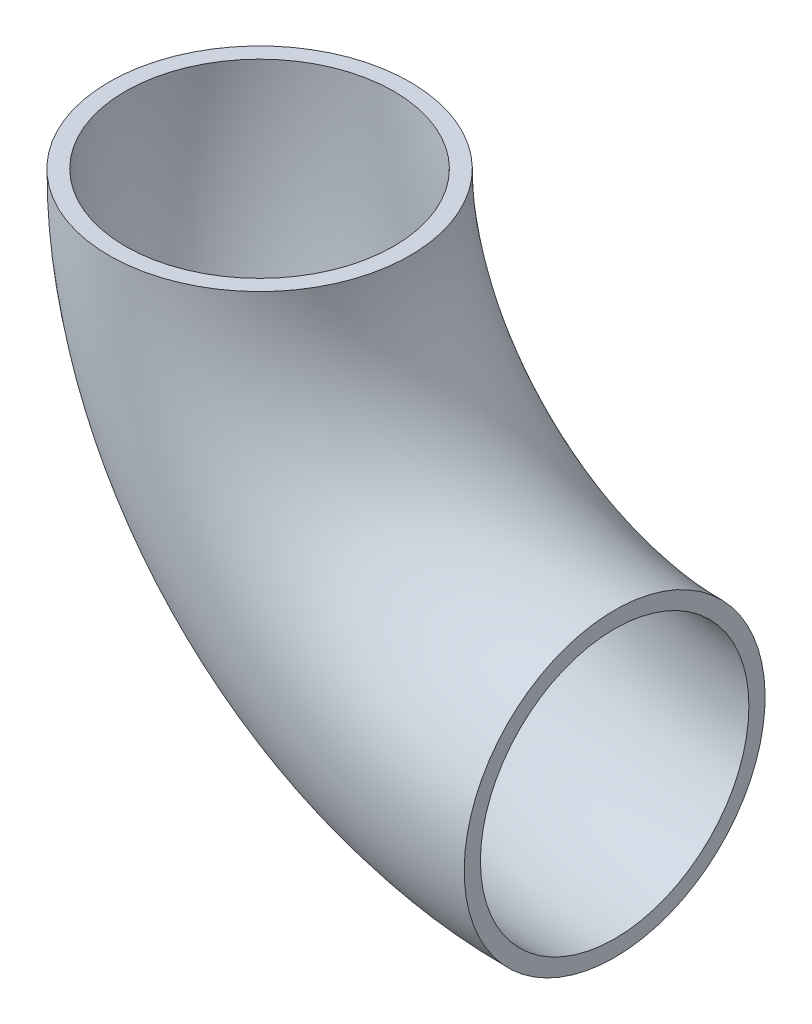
ISO-10303-21;
HEADER;
FILE_DESCRIPTION(('STEP AP214'),'2;1');
FILE_NAME('part.step','',(''),(''),'','','');
FILE_SCHEMA(('AUTOMOTIVE_DESIGN { 1 0 10303 214 1 1 1 1 }'));
ENDSEC;
DATA;
#1=APPLICATION_CONTEXT('core data for automotive mechanical design processes');
#2=APPLICATION_PROTOCOL_DEFINITION('international standard','automotive_design',2000,#1);
#3=PRODUCT_CONTEXT('',#1,'mechanical');
#4=PRODUCT('Part','Part','',(#3));
#5=PRODUCT_RELATED_PRODUCT_CATEGORY('part','',(#4));
#6=PRODUCT_DEFINITION_FORMATION('','',#4);
#7=PRODUCT_DEFINITION_CONTEXT('part definition',#1,'design');
#8=PRODUCT_DEFINITION('design','',#6,#7);
#9=PRODUCT_DEFINITION_SHAPE('','',#8);
#10=(LENGTH_UNIT() NAMED_UNIT(*) SI_UNIT(.MILLI.,.METRE.));
#11=(NAMED_UNIT(*) PLANE_ANGLE_UNIT() SI_UNIT($,.RADIAN.));
#12=(NAMED_UNIT(*) SI_UNIT($,.STERADIAN.) SOLID_ANGLE_UNIT());
#13=UNCERTAINTY_MEASURE_WITH_UNIT(LENGTH_MEASURE(1.E-05),#10,'distance_accuracy_value','');
#14=(GEOMETRIC_REPRESENTATION_CONTEXT(3) GLOBAL_UNCERTAINTY_ASSIGNED_CONTEXT((#13)) GLOBAL_UNIT_ASSIGNED_CONTEXT((#10,
#11,#12)) REPRESENTATION_CONTEXT('',''));
#15=CARTESIAN_POINT('',(0.,0.,0.));
#16=DIRECTION('',(0.,0.,1.));
#17=DIRECTION('',(1.,0.,0.));
#18=AXIS2_PLACEMENT_3D('',#15,#16,#17);
#19=CARTESIAN_POINT('',(557.,-358.,0.));
#20=DIRECTION('',(0.,0.,-1.));
#21=DIRECTION('',(-1.,0.,0.));
#22=AXIS2_PLACEMENT_3D('',#19,#20,#21);
#23=TOROIDAL_SURFACE('',#22,57.0000000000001,24.15);
#24=CARTESIAN_POINT('',(557.,-415.,0.));
#25=DIRECTION('',(1.,0.,0.));
#26=DIRECTION('',(0.,0.,-1.));
#27=AXIS2_PLACEMENT_3D('',#24,#25,#26);
#28=CIRCLE('',#27,24.15);
#29=CARTESIAN_POINT('',(557.,-439.15,0.));
#30=VERTEX_POINT('',#29);
#31=EDGE_CURVE('E10',#30,#30,#28,.T.);
#32=CARTESIAN_POINT('',(500.,-358.,0.));
#33=DIRECTION('',(0.,-1.,0.));
#34=DIRECTION('',(0.,0.,-1.));
#35=AXIS2_PLACEMENT_3D('',#32,#33,#34);
#36=CIRCLE('',#35,24.15);
#37=CARTESIAN_POINT('',(475.85,-358.,0.));
#38=VERTEX_POINT('',#37);
#39=EDGE_CURVE('E39',#38,#38,#36,.T.);
#40=CARTESIAN_POINT('',(557.,-358.,0.));
#41=DIRECTION('',(0.,0.,-1.));
#42=DIRECTION('',(-1.,0.,0.));
#43=AXIS2_PLACEMENT_3D('',#40,#41,#42);
#44=CIRCLE('',#43,81.1500000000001);
#45=EDGE_CURVE('',#30,#38,#44,.T.);
#46=ORIENTED_EDGE('',*,*,#31,.F.);
#47=ORIENTED_EDGE('',*,*,#39,.T.);
#48=ORIENTED_EDGE('',*,*,#45,.T.);
#49=ORIENTED_EDGE('',*,*,#45,.F.);
#50=EDGE_LOOP('',(#46,#48,#47,#49));
#51=FACE_BOUND('',#50,.T.);
#52=ADVANCED_FACE('F33',(#51),#23,.T.);
#53=CARTESIAN_POINT('',(557.,-415.,0.));
#54=DIRECTION('',(1.,0.,0.));
#55=DIRECTION('',(0.,0.,-1.));
#56=AXIS2_PLACEMENT_3D('',#53,#54,#55);
#57=PLANE('',#56);
#58=CARTESIAN_POINT('',(557.,-415.,0.));
#59=DIRECTION('',(1.,0.,0.));
#60=DIRECTION('',(0.,1.,0.));
#61=AXIS2_PLACEMENT_3D('',#58,#59,#60);
#62=CIRCLE('',#61,21.55);
#63=CARTESIAN_POINT('',(557.,-436.55,0.));
#64=VERTEX_POINT('',#63);
#65=EDGE_CURVE('E43',#64,#64,#62,.T.);
#66=ORIENTED_EDGE('',*,*,#65,.F.);
#67=EDGE_LOOP('',(#66));
#68=FACE_BOUND('',#67,.T.);
#69=ORIENTED_EDGE('',*,*,#31,.T.);
#70=EDGE_LOOP('',(#69));
#71=FACE_BOUND('',#70,.T.);
#72=ADVANCED_FACE('F63',(#68,#71),#57,.T.);
#73=CARTESIAN_POINT('',(500.,-358.,0.));
#74=DIRECTION('',(0.,-1.,0.));
#75=DIRECTION('',(0.,0.,-1.));
#76=AXIS2_PLACEMENT_3D('',#73,#74,#75);
#77=PLANE('',#76);
#78=CARTESIAN_POINT('',(500.,-358.,0.));
#79=DIRECTION('',(0.,-1.,0.));
#80=DIRECTION('',(0.,0.,-1.));
#81=AXIS2_PLACEMENT_3D('',#78,#79,#80);
#82=CIRCLE('',#81,21.55);
#83=CARTESIAN_POINT('',(478.45,-358.,0.));
#84=VERTEX_POINT('',#83);
#85=EDGE_CURVE('E47',#84,#84,#82,.T.);
#86=ORIENTED_EDGE('',*,*,#85,.T.);
#87=EDGE_LOOP('',(#86));
#88=FACE_BOUND('',#87,.T.);
#89=ORIENTED_EDGE('',*,*,#39,.F.);
#90=EDGE_LOOP('',(#89));
#91=FACE_BOUND('',#90,.T.);
#92=ADVANCED_FACE('F53',(#88,#91),#77,.F.);
#93=CARTESIAN_POINT('',(557.,-358.,0.));
#94=DIRECTION('',(0.,0.,-1.));
#95=DIRECTION('',(-1.,0.,0.));
#96=AXIS2_PLACEMENT_3D('',#93,#94,#95);
#97=TOROIDAL_SURFACE('',#96,57.0000000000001,21.55);
#98=CARTESIAN_POINT('',(557.,-358.,0.));
#99=DIRECTION('',(0.,0.,-1.));
#100=DIRECTION('',(-1.,0.,0.));
#101=AXIS2_PLACEMENT_3D('',#98,#99,#100);
#102=CIRCLE('',#101,78.5500000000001);
#103=EDGE_CURVE('',#64,#84,#102,.T.);
#104=ORIENTED_EDGE('',*,*,#65,.T.);
#105=ORIENTED_EDGE('',*,*,#85,.F.);
#106=ORIENTED_EDGE('',*,*,#103,.T.);
#107=ORIENTED_EDGE('',*,*,#103,.F.);
#108=EDGE_LOOP('',(#104,#106,#105,#107));
#109=FACE_BOUND('',#108,.T.);
#110=ADVANCED_FACE('F56',(#109),#97,.F.);
#111=CLOSED_SHELL('',(#52,#72,#92,#110));
#112=MANIFOLD_SOLID_BREP('B2',#111);
#113=ADVANCED_BREP_SHAPE_REPRESENTATION('',(#18,#112),#14);
#114=SHAPE_DEFINITION_REPRESENTATION(#9,#113);
ENDSEC;
END-ISO-10303-21;
